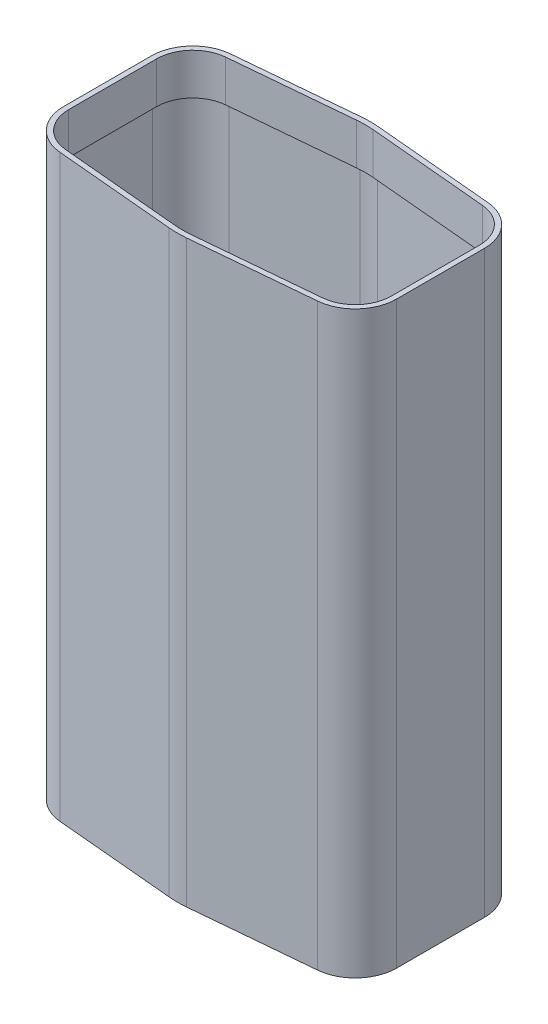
from build123d import *

# Parameters (mm, degrees)
BOSS_EXTRUDE1_DEPTH = 711.2
CUT_EXTRUDE1_DEPTH  = 186.266666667
LPATTERN1_COUNT     = 3
LPATTERN1_PITCH     = 224.366666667


with BuildPart() as part:
    # Sketch1 → Boss-Extrude1 (new body)
    with BuildSketch(Plane(origin=(0, 0, 0), x_dir=(1, 0, 0), z_dir=(0, 1, 0))):
        with BuildLine():
            Line((-204.474263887, 53.975), (-204.474263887, -53.975))
            ThreePointArc((-204.474263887, -53.975), (-191.181638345, -88.236302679), (-158.260214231, -104.567579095))
            Line((-158.260214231, -104.567579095), (-10.69099674, -117.943950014))
            ThreePointArc((-10.69099674, -117.943950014), (0, -118.4275), (10.69099674, -117.943950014))
            Line((10.69099674, -117.943950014), (158.260214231, -104.567579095))
            ThreePointArc((158.260214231, -104.567579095), (191.181638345, -88.236302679), (204.474263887, -53.975))
            Line((204.474263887, -53.975), (204.474263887, 53.975))
            ThreePointArc((204.474263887, 53.975), (191.181638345, 88.236302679), (158.260214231, 104.567579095))
            Line((158.260214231, 104.567579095), (10.69099674, 117.943950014))
            ThreePointArc((10.69099674, 117.943950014), (0, 118.4275), (-10.69099674, 117.943950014))
            Line((-10.69099674, 117.943950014), (-158.260214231, 104.567579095))
            ThreePointArc((-158.260214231, 104.567579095), (-191.181638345, 88.236302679), (-204.474263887, 53.975))
        make_face()
        with BuildLine():
            Line((-198.124263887, 53.975), (-198.124263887, -53.975))
            ThreePointArc((-198.124263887, -53.975), (-186.493216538, -83.953639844), (-157.686970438, -98.243506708))
            Line((-157.686970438, -98.243506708), (-10.117752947, -111.619877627))
            ThreePointArc((-10.117752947, -111.619877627), (0, -112.0775), (10.117752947, -111.619877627))
            Line((10.117752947, -111.619877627), (157.686970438, -98.243506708))
            ThreePointArc((157.686970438, -98.243506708), (186.493216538, -83.953639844), (198.124263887, -53.975))
            Line((198.124263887, -53.975), (198.124263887, 53.975))
            ThreePointArc((198.124263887, 53.975), (186.493216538, 83.953639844), (157.686970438, 98.243506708))
            Line((157.686970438, 98.243506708), (10.117752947, 111.619877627))
            ThreePointArc((10.117752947, 111.619877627), (0, 112.0775), (-10.117752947, 111.619877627))
            Line((-10.117752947, 111.619877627), (-157.686970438, 98.243506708))
            ThreePointArc((-157.686970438, 98.243506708), (-186.493216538, 83.953639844), (-198.124263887, 53.975))
        make_face(mode=Mode.SUBTRACT)
    extrude(amount=BOSS_EXTRUDE1_DEPTH)

    # Sketch2 → Cut-Extrude1 (cut)
    with BuildSketch(Plane(origin=(0, 25.4, 0), x_dir=(1, 0, 0), z_dir=(0, 1, 0))):
        with BuildLine():
            Line((-202.886763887, 53.975), (-202.886763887, -53.975))
            ThreePointArc((-202.886763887, -53.975), (-190.009532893, -87.16563697), (-158.116903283, -102.986560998))
            Line((-158.116903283, -102.986560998), (-10.547685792, -116.362931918))
            ThreePointArc((-10.547685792, -116.362931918), (0, -116.84), (10.547685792, -116.362931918))
            Line((10.547685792, -116.362931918), (158.116903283, -102.986560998))
            ThreePointArc((158.116903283, -102.986560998), (190.009532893, -87.16563697), (202.886763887, -53.975))
            Line((202.886763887, -53.975), (202.886763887, 53.975))
            ThreePointArc((202.886763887, 53.975), (190.009532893, 87.16563697), (158.116903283, 102.986560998))
            Line((158.116903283, 102.986560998), (10.547685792, 116.362931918))
            ThreePointArc((10.547685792, 116.362931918), (0, 116.84), (-10.547685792, 116.362931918))
            Line((-10.547685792, 116.362931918), (-158.116903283, 102.986560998))
            ThreePointArc((-158.116903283, 102.986560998), (-190.009532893, 87.16563697), (-202.886763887, 53.975))
        make_face()
    cut_extrude1 = extrude(amount=CUT_EXTRUDE1_DEPTH, mode=Mode.SUBTRACT)

    # LPattern1: Cut-Extrude1 ×3
    with Locations(*[(0, i * LPATTERN1_PITCH, 0) for i in range(1, LPATTERN1_COUNT)]):
        add(cut_extrude1, mode=Mode.SUBTRACT)


solid = part.part
